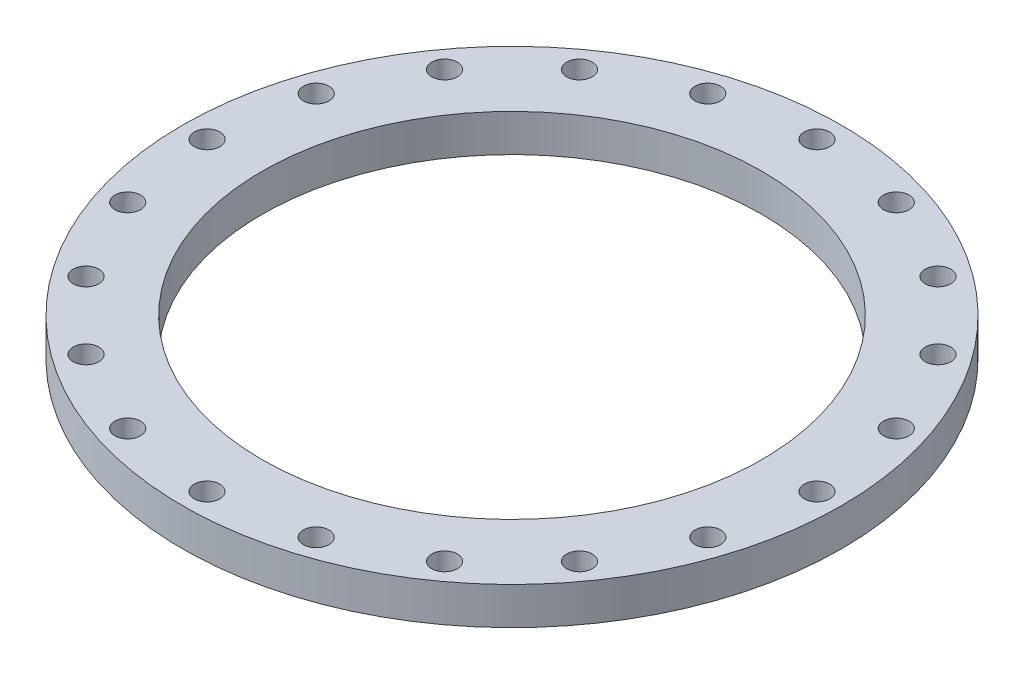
ISO-10303-21;
HEADER;
FILE_DESCRIPTION(('STEP AP214'),'2;1');
FILE_NAME('part.step','',(''),(''),'','','');
FILE_SCHEMA(('AUTOMOTIVE_DESIGN { 1 0 10303 214 1 1 1 1 }'));
ENDSEC;
DATA;
#1=APPLICATION_CONTEXT('core data for automotive mechanical design processes');
#2=APPLICATION_PROTOCOL_DEFINITION('international standard','automotive_design',2000,#1);
#3=PRODUCT_CONTEXT('',#1,'mechanical');
#4=PRODUCT('Part','Part','',(#3));
#5=PRODUCT_RELATED_PRODUCT_CATEGORY('part','',(#4));
#6=PRODUCT_DEFINITION_FORMATION('','',#4);
#7=PRODUCT_DEFINITION_CONTEXT('part definition',#1,'design');
#8=PRODUCT_DEFINITION('design','',#6,#7);
#9=PRODUCT_DEFINITION_SHAPE('','',#8);
#10=(LENGTH_UNIT() NAMED_UNIT(*) SI_UNIT(.MILLI.,.METRE.));
#11=(NAMED_UNIT(*) PLANE_ANGLE_UNIT() SI_UNIT($,.RADIAN.));
#12=(NAMED_UNIT(*) SI_UNIT($,.STERADIAN.) SOLID_ANGLE_UNIT());
#13=UNCERTAINTY_MEASURE_WITH_UNIT(LENGTH_MEASURE(1.E-05),#10,'distance_accuracy_value','');
#14=(GEOMETRIC_REPRESENTATION_CONTEXT(3) GLOBAL_UNCERTAINTY_ASSIGNED_CONTEXT((#13)) GLOBAL_UNIT_ASSIGNED_CONTEXT((#10,
#11,#12)) REPRESENTATION_CONTEXT('',''));
#15=CARTESIAN_POINT('',(0.,0.,0.));
#16=DIRECTION('',(0.,0.,1.));
#17=DIRECTION('',(1.,0.,0.));
#18=AXIS2_PLACEMENT_3D('',#15,#16,#17);
#19=CARTESIAN_POINT('',(0.,38.,0.));
#20=DIRECTION('',(0.,1.,0.));
#21=DIRECTION('',(0.,0.,1.));
#22=AXIS2_PLACEMENT_3D('',#19,#20,#21);
#23=PLANE('',#22);
#24=CARTESIAN_POINT('',(294.827520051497,38.,95.7952682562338));
#25=DIRECTION('',(0.,1.,0.));
#26=DIRECTION('',(0.,0.,1.));
#27=AXIS2_PLACEMENT_3D('',#24,#25,#26);
#28=CIRCLE('',#27,13.);
#29=CARTESIAN_POINT('',(294.827520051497,38.,108.795268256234));
#30=VERTEX_POINT('',#29);
#31=EDGE_CURVE('E133',#30,#30,#28,.T.);
#32=ORIENTED_EDGE('',*,*,#31,.F.);
#33=EDGE_LOOP('',(#32));
#34=FACE_BOUND('',#33,.T.);
#35=CARTESIAN_POINT('',(250.795268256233,38.,182.213428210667));
#36=DIRECTION('',(0.,1.,0.));
#37=DIRECTION('',(0.,0.,1.));
#38=AXIS2_PLACEMENT_3D('',#35,#36,#37);
#39=CIRCLE('',#38,13.);
#40=CARTESIAN_POINT('',(250.795268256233,38.,195.213428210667));
#41=VERTEX_POINT('',#40);
#42=EDGE_CURVE('E129',#41,#41,#39,.T.);
#43=ORIENTED_EDGE('',*,*,#42,.F.);
#44=EDGE_LOOP('',(#43));
#45=FACE_BOUND('',#44,.T.);
#46=CARTESIAN_POINT('',(182.213428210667,38.,250.795268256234));
#47=DIRECTION('',(0.,1.,0.));
#48=DIRECTION('',(0.,0.,1.));
#49=AXIS2_PLACEMENT_3D('',#46,#47,#48);
#50=CIRCLE('',#49,13.);
#51=CARTESIAN_POINT('',(182.213428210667,38.,263.795268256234));
#52=VERTEX_POINT('',#51);
#53=EDGE_CURVE('E125',#52,#52,#50,.T.);
#54=ORIENTED_EDGE('',*,*,#53,.F.);
#55=EDGE_LOOP('',(#54));
#56=FACE_BOUND('',#55,.T.);
#57=CARTESIAN_POINT('',(95.7952682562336,38.,294.827520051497));
#58=DIRECTION('',(0.,1.,0.));
#59=DIRECTION('',(0.,0.,1.));
#60=AXIS2_PLACEMENT_3D('',#57,#58,#59);
#61=CIRCLE('',#60,13.);
#62=CARTESIAN_POINT('',(95.7952682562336,38.,307.827520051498));
#63=VERTEX_POINT('',#62);
#64=EDGE_CURVE('E120',#63,#63,#61,.T.);
#65=ORIENTED_EDGE('',*,*,#64,.F.);
#66=EDGE_LOOP('',(#65));
#67=FACE_BOUND('',#66,.T.);
#68=CARTESIAN_POINT('',(0.,38.,310.));
#69=DIRECTION('',(0.,1.,0.));
#70=DIRECTION('',(0.,0.,1.));
#71=AXIS2_PLACEMENT_3D('',#68,#69,#70);
#72=CIRCLE('',#71,13.);
#73=CARTESIAN_POINT('',(0.,38.,323.));
#74=VERTEX_POINT('',#73);
#75=EDGE_CURVE('E115',#74,#74,#72,.T.);
#76=ORIENTED_EDGE('',*,*,#75,.F.);
#77=EDGE_LOOP('',(#76));
#78=FACE_BOUND('',#77,.T.);
#79=CARTESIAN_POINT('',(-95.7952682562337,38.,294.827520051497));
#80=DIRECTION('',(0.,1.,0.));
#81=DIRECTION('',(0.,0.,1.));
#82=AXIS2_PLACEMENT_3D('',#79,#80,#81);
#83=CIRCLE('',#82,13.);
#84=CARTESIAN_POINT('',(-95.7952682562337,38.,307.827520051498));
#85=VERTEX_POINT('',#84);
#86=EDGE_CURVE('E110',#85,#85,#83,.T.);
#87=ORIENTED_EDGE('',*,*,#86,.F.);
#88=EDGE_LOOP('',(#87));
#89=FACE_BOUND('',#88,.T.);
#90=CARTESIAN_POINT('',(-182.213428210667,38.,250.795268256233));
#91=DIRECTION('',(0.,1.,0.));
#92=DIRECTION('',(0.,0.,1.));
#93=AXIS2_PLACEMENT_3D('',#90,#91,#92);
#94=CIRCLE('',#93,13.);
#95=CARTESIAN_POINT('',(-182.213428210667,38.,263.795268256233));
#96=VERTEX_POINT('',#95);
#97=EDGE_CURVE('E105',#96,#96,#94,.T.);
#98=ORIENTED_EDGE('',*,*,#97,.F.);
#99=EDGE_LOOP('',(#98));
#100=FACE_BOUND('',#99,.T.);
#101=CARTESIAN_POINT('',(-250.795268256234,38.,182.213428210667));
#102=DIRECTION('',(0.,1.,0.));
#103=DIRECTION('',(0.,0.,1.));
#104=AXIS2_PLACEMENT_3D('',#101,#102,#103);
#105=CIRCLE('',#104,13.);
#106=CARTESIAN_POINT('',(-250.795268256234,38.,195.213428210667));
#107=VERTEX_POINT('',#106);
#108=EDGE_CURVE('E100',#107,#107,#105,.T.);
#109=ORIENTED_EDGE('',*,*,#108,.F.);
#110=EDGE_LOOP('',(#109));
#111=FACE_BOUND('',#110,.T.);
#112=CARTESIAN_POINT('',(-294.827520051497,38.,95.7952682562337));
#113=DIRECTION('',(0.,1.,0.));
#114=DIRECTION('',(0.,0.,1.));
#115=AXIS2_PLACEMENT_3D('',#112,#113,#114);
#116=CIRCLE('',#115,13.);
#117=CARTESIAN_POINT('',(-294.827520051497,38.,108.795268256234));
#118=VERTEX_POINT('',#117);
#119=EDGE_CURVE('E95',#118,#118,#116,.T.);
#120=ORIENTED_EDGE('',*,*,#119,.F.);
#121=EDGE_LOOP('',(#120));
#122=FACE_BOUND('',#121,.T.);
#123=CARTESIAN_POINT('',(-310.,38.,0.));
#124=DIRECTION('',(0.,1.,0.));
#125=DIRECTION('',(0.,0.,1.));
#126=AXIS2_PLACEMENT_3D('',#123,#124,#125);
#127=CIRCLE('',#126,13.);
#128=CARTESIAN_POINT('',(-310.,38.,13.));
#129=VERTEX_POINT('',#128);
#130=EDGE_CURVE('E90',#129,#129,#127,.T.);
#131=ORIENTED_EDGE('',*,*,#130,.F.);
#132=EDGE_LOOP('',(#131));
#133=FACE_BOUND('',#132,.T.);
#134=CARTESIAN_POINT('',(-294.827520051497,38.,-95.7952682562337));
#135=DIRECTION('',(0.,1.,0.));
#136=DIRECTION('',(0.,0.,1.));
#137=AXIS2_PLACEMENT_3D('',#134,#135,#136);
#138=CIRCLE('',#137,13.);
#139=CARTESIAN_POINT('',(-294.827520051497,38.,-82.7952682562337));
#140=VERTEX_POINT('',#139);
#141=EDGE_CURVE('E85',#140,#140,#138,.T.);
#142=ORIENTED_EDGE('',*,*,#141,.F.);
#143=EDGE_LOOP('',(#142));
#144=FACE_BOUND('',#143,.T.);
#145=CARTESIAN_POINT('',(-250.795268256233,38.,-182.213428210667));
#146=DIRECTION('',(0.,1.,0.));
#147=DIRECTION('',(0.,0.,1.));
#148=AXIS2_PLACEMENT_3D('',#145,#146,#147);
#149=CIRCLE('',#148,13.);
#150=CARTESIAN_POINT('',(-250.795268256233,38.,-169.213428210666));
#151=VERTEX_POINT('',#150);
#152=EDGE_CURVE('E80',#151,#151,#149,.T.);
#153=ORIENTED_EDGE('',*,*,#152,.F.);
#154=EDGE_LOOP('',(#153));
#155=FACE_BOUND('',#154,.T.);
#156=CARTESIAN_POINT('',(-182.213428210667,38.,-250.795268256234));
#157=DIRECTION('',(0.,1.,0.));
#158=DIRECTION('',(0.,0.,1.));
#159=AXIS2_PLACEMENT_3D('',#156,#157,#158);
#160=CIRCLE('',#159,13.);
#161=CARTESIAN_POINT('',(-182.213428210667,38.,-237.795268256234));
#162=VERTEX_POINT('',#161);
#163=EDGE_CURVE('E75',#162,#162,#160,.T.);
#164=ORIENTED_EDGE('',*,*,#163,.F.);
#165=EDGE_LOOP('',(#164));
#166=FACE_BOUND('',#165,.T.);
#167=CARTESIAN_POINT('',(-95.7952682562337,38.,-294.827520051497));
#168=DIRECTION('',(0.,1.,0.));
#169=DIRECTION('',(0.,0.,1.));
#170=AXIS2_PLACEMENT_3D('',#167,#168,#169);
#171=CIRCLE('',#170,13.);
#172=CARTESIAN_POINT('',(-95.7952682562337,38.,-281.827520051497));
#173=VERTEX_POINT('',#172);
#174=EDGE_CURVE('E70',#173,#173,#171,.T.);
#175=ORIENTED_EDGE('',*,*,#174,.F.);
#176=EDGE_LOOP('',(#175));
#177=FACE_BOUND('',#176,.T.);
#178=CARTESIAN_POINT('',(0.,38.,-310.));
#179=DIRECTION('',(0.,1.,0.));
#180=DIRECTION('',(0.,0.,1.));
#181=AXIS2_PLACEMENT_3D('',#178,#179,#180);
#182=CIRCLE('',#181,13.);
#183=CARTESIAN_POINT('',(0.,38.,-297.));
#184=VERTEX_POINT('',#183);
#185=EDGE_CURVE('E65',#184,#184,#182,.T.);
#186=ORIENTED_EDGE('',*,*,#185,.F.);
#187=EDGE_LOOP('',(#186));
#188=FACE_BOUND('',#187,.T.);
#189=CARTESIAN_POINT('',(95.7952682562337,38.,-294.827520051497));
#190=DIRECTION('',(0.,1.,0.));
#191=DIRECTION('',(0.,0.,1.));
#192=AXIS2_PLACEMENT_3D('',#189,#190,#191);
#193=CIRCLE('',#192,13.);
#194=CARTESIAN_POINT('',(95.7952682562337,38.,-281.827520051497));
#195=VERTEX_POINT('',#194);
#196=EDGE_CURVE('E60',#195,#195,#193,.T.);
#197=ORIENTED_EDGE('',*,*,#196,.F.);
#198=EDGE_LOOP('',(#197));
#199=FACE_BOUND('',#198,.T.);
#200=CARTESIAN_POINT('',(182.213428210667,38.,-250.795268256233));
#201=DIRECTION('',(0.,1.,0.));
#202=DIRECTION('',(0.,0.,1.));
#203=AXIS2_PLACEMENT_3D('',#200,#201,#202);
#204=CIRCLE('',#203,13.);
#205=CARTESIAN_POINT('',(182.213428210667,38.,-237.795268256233));
#206=VERTEX_POINT('',#205);
#207=EDGE_CURVE('E55',#206,#206,#204,.T.);
#208=ORIENTED_EDGE('',*,*,#207,.F.);
#209=EDGE_LOOP('',(#208));
#210=FACE_BOUND('',#209,.T.);
#211=CARTESIAN_POINT('',(250.795268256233,38.,-182.213428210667));
#212=DIRECTION('',(0.,1.,0.));
#213=DIRECTION('',(0.,0.,1.));
#214=AXIS2_PLACEMENT_3D('',#211,#212,#213);
#215=CIRCLE('',#214,13.);
#216=CARTESIAN_POINT('',(250.795268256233,38.,-169.213428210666));
#217=VERTEX_POINT('',#216);
#218=EDGE_CURVE('E50',#217,#217,#215,.T.);
#219=ORIENTED_EDGE('',*,*,#218,.F.);
#220=EDGE_LOOP('',(#219));
#221=FACE_BOUND('',#220,.T.);
#222=CARTESIAN_POINT('',(294.827520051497,38.,-95.7952682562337));
#223=DIRECTION('',(0.,1.,0.));
#224=DIRECTION('',(0.,0.,1.));
#225=AXIS2_PLACEMENT_3D('',#222,#223,#224);
#226=CIRCLE('',#225,13.);
#227=CARTESIAN_POINT('',(294.827520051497,38.,-82.7952682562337));
#228=VERTEX_POINT('',#227);
#229=EDGE_CURVE('E45',#228,#228,#226,.T.);
#230=ORIENTED_EDGE('',*,*,#229,.F.);
#231=EDGE_LOOP('',(#230));
#232=FACE_BOUND('',#231,.T.);
#233=CARTESIAN_POINT('',(310.,38.,0.));
#234=DIRECTION('',(0.,1.,0.));
#235=DIRECTION('',(0.,0.,1.));
#236=AXIS2_PLACEMENT_3D('',#233,#234,#235);
#237=CIRCLE('',#236,13.);
#238=CARTESIAN_POINT('',(310.,38.,13.));
#239=VERTEX_POINT('',#238);
#240=EDGE_CURVE('E40',#239,#239,#237,.T.);
#241=ORIENTED_EDGE('',*,*,#240,.F.);
#242=EDGE_LOOP('',(#241));
#243=FACE_BOUND('',#242,.T.);
#244=CARTESIAN_POINT('',(0.,38.,0.));
#245=DIRECTION('',(0.,1.,0.));
#246=DIRECTION('',(0.,0.,1.));
#247=AXIS2_PLACEMENT_3D('',#244,#245,#246);
#248=CIRCLE('',#247,254.);
#249=CARTESIAN_POINT('',(0.,38.,254.));
#250=VERTEX_POINT('',#249);
#251=EDGE_CURVE('E32',#250,#250,#248,.T.);
#252=ORIENTED_EDGE('',*,*,#251,.F.);
#253=EDGE_LOOP('',(#252));
#254=FACE_BOUND('',#253,.T.);
#255=CARTESIAN_POINT('',(0.,38.,0.));
#256=DIRECTION('',(0.,-1.,0.));
#257=DIRECTION('',(1.,0.,0.));
#258=AXIS2_PLACEMENT_3D('',#255,#256,#257);
#259=CIRCLE('',#258,335.);
#260=CARTESIAN_POINT('',(335.,38.,0.));
#261=VERTEX_POINT('',#260);
#262=EDGE_CURVE('E8',#261,#261,#259,.T.);
#263=ORIENTED_EDGE('',*,*,#262,.F.);
#264=EDGE_LOOP('',(#263));
#265=FACE_BOUND('',#264,.T.);
#266=ADVANCED_FACE('F13',(#34,#45,#56,#67,#78,#89,#100,#111,#122,#133,#144,#155,#166,#177,#188,
#199,#210,#221,#232,#243,#254,#265),#23,.T.);
#267=CARTESIAN_POINT('',(0.,0.,0.));
#268=DIRECTION('',(0.,-1.,0.));
#269=DIRECTION('',(0.,0.,-1.));
#270=AXIS2_PLACEMENT_3D('',#267,#268,#269);
#271=PLANE('',#270);
#272=CARTESIAN_POINT('',(294.827520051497,0.,95.7952682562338));
#273=DIRECTION('',(0.,-1.,0.));
#274=DIRECTION('',(0.,0.,-1.));
#275=AXIS2_PLACEMENT_3D('',#272,#273,#274);
#276=CIRCLE('',#275,13.);
#277=CARTESIAN_POINT('',(294.827520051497,0.,82.7952682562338));
#278=VERTEX_POINT('',#277);
#279=EDGE_CURVE('E17',#278,#278,#276,.T.);
#280=ORIENTED_EDGE('',*,*,#279,.F.);
#281=EDGE_LOOP('',(#280));
#282=FACE_BOUND('',#281,.T.);
#283=CARTESIAN_POINT('',(250.795268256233,0.,182.213428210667));
#284=DIRECTION('',(0.,-1.,0.));
#285=DIRECTION('',(0.,0.,-1.));
#286=AXIS2_PLACEMENT_3D('',#283,#284,#285);
#287=CIRCLE('',#286,13.);
#288=CARTESIAN_POINT('',(250.795268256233,0.,169.213428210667));
#289=VERTEX_POINT('',#288);
#290=EDGE_CURVE('E130',#289,#289,#287,.T.);
#291=ORIENTED_EDGE('',*,*,#290,.F.);
#292=EDGE_LOOP('',(#291));
#293=FACE_BOUND('',#292,.T.);
#294=CARTESIAN_POINT('',(182.213428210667,0.,250.795268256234));
#295=DIRECTION('',(0.,-1.,0.));
#296=DIRECTION('',(0.,0.,-1.));
#297=AXIS2_PLACEMENT_3D('',#294,#295,#296);
#298=CIRCLE('',#297,13.);
#299=CARTESIAN_POINT('',(182.213428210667,0.,237.795268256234));
#300=VERTEX_POINT('',#299);
#301=EDGE_CURVE('E126',#300,#300,#298,.T.);
#302=ORIENTED_EDGE('',*,*,#301,.F.);
#303=EDGE_LOOP('',(#302));
#304=FACE_BOUND('',#303,.T.);
#305=CARTESIAN_POINT('',(95.7952682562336,0.,294.827520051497));
#306=DIRECTION('',(0.,-1.,0.));
#307=DIRECTION('',(0.,0.,-1.));
#308=AXIS2_PLACEMENT_3D('',#305,#306,#307);
#309=CIRCLE('',#308,13.);
#310=CARTESIAN_POINT('',(95.7952682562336,0.,281.827520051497));
#311=VERTEX_POINT('',#310);
#312=EDGE_CURVE('E121',#311,#311,#309,.T.);
#313=ORIENTED_EDGE('',*,*,#312,.F.);
#314=EDGE_LOOP('',(#313));
#315=FACE_BOUND('',#314,.T.);
#316=CARTESIAN_POINT('',(0.,0.,310.));
#317=DIRECTION('',(0.,-1.,0.));
#318=DIRECTION('',(0.,0.,-1.));
#319=AXIS2_PLACEMENT_3D('',#316,#317,#318);
#320=CIRCLE('',#319,13.);
#321=CARTESIAN_POINT('',(0.,0.,297.));
#322=VERTEX_POINT('',#321);
#323=EDGE_CURVE('E116',#322,#322,#320,.T.);
#324=ORIENTED_EDGE('',*,*,#323,.F.);
#325=EDGE_LOOP('',(#324));
#326=FACE_BOUND('',#325,.T.);
#327=CARTESIAN_POINT('',(-95.7952682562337,0.,294.827520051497));
#328=DIRECTION('',(0.,-1.,0.));
#329=DIRECTION('',(0.,0.,-1.));
#330=AXIS2_PLACEMENT_3D('',#327,#328,#329);
#331=CIRCLE('',#330,13.);
#332=CARTESIAN_POINT('',(-95.7952682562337,0.,281.827520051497));
#333=VERTEX_POINT('',#332);
#334=EDGE_CURVE('E111',#333,#333,#331,.T.);
#335=ORIENTED_EDGE('',*,*,#334,.F.);
#336=EDGE_LOOP('',(#335));
#337=FACE_BOUND('',#336,.T.);
#338=CARTESIAN_POINT('',(-182.213428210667,0.,250.795268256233));
#339=DIRECTION('',(0.,-1.,0.));
#340=DIRECTION('',(0.,0.,-1.));
#341=AXIS2_PLACEMENT_3D('',#338,#339,#340);
#342=CIRCLE('',#341,13.);
#343=CARTESIAN_POINT('',(-182.213428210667,0.,237.795268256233));
#344=VERTEX_POINT('',#343);
#345=EDGE_CURVE('E106',#344,#344,#342,.T.);
#346=ORIENTED_EDGE('',*,*,#345,.F.);
#347=EDGE_LOOP('',(#346));
#348=FACE_BOUND('',#347,.T.);
#349=CARTESIAN_POINT('',(-250.795268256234,0.,182.213428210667));
#350=DIRECTION('',(0.,-1.,0.));
#351=DIRECTION('',(0.,0.,-1.));
#352=AXIS2_PLACEMENT_3D('',#349,#350,#351);
#353=CIRCLE('',#352,13.);
#354=CARTESIAN_POINT('',(-250.795268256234,0.,169.213428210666));
#355=VERTEX_POINT('',#354);
#356=EDGE_CURVE('E101',#355,#355,#353,.T.);
#357=ORIENTED_EDGE('',*,*,#356,.F.);
#358=EDGE_LOOP('',(#357));
#359=FACE_BOUND('',#358,.T.);
#360=CARTESIAN_POINT('',(-294.827520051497,0.,95.7952682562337));
#361=DIRECTION('',(0.,-1.,0.));
#362=DIRECTION('',(0.,0.,-1.));
#363=AXIS2_PLACEMENT_3D('',#360,#361,#362);
#364=CIRCLE('',#363,13.);
#365=CARTESIAN_POINT('',(-294.827520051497,0.,82.7952682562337));
#366=VERTEX_POINT('',#365);
#367=EDGE_CURVE('E96',#366,#366,#364,.T.);
#368=ORIENTED_EDGE('',*,*,#367,.F.);
#369=EDGE_LOOP('',(#368));
#370=FACE_BOUND('',#369,.T.);
#371=CARTESIAN_POINT('',(-310.,0.,0.));
#372=DIRECTION('',(0.,-1.,0.));
#373=DIRECTION('',(0.,0.,-1.));
#374=AXIS2_PLACEMENT_3D('',#371,#372,#373);
#375=CIRCLE('',#374,13.);
#376=CARTESIAN_POINT('',(-310.,0.,-13.));
#377=VERTEX_POINT('',#376);
#378=EDGE_CURVE('E91',#377,#377,#375,.T.);
#379=ORIENTED_EDGE('',*,*,#378,.F.);
#380=EDGE_LOOP('',(#379));
#381=FACE_BOUND('',#380,.T.);
#382=CARTESIAN_POINT('',(-294.827520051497,0.,-95.7952682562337));
#383=DIRECTION('',(0.,-1.,0.));
#384=DIRECTION('',(0.,0.,-1.));
#385=AXIS2_PLACEMENT_3D('',#382,#383,#384);
#386=CIRCLE('',#385,13.);
#387=CARTESIAN_POINT('',(-294.827520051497,0.,-108.795268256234));
#388=VERTEX_POINT('',#387);
#389=EDGE_CURVE('E86',#388,#388,#386,.T.);
#390=ORIENTED_EDGE('',*,*,#389,.F.);
#391=EDGE_LOOP('',(#390));
#392=FACE_BOUND('',#391,.T.);
#393=CARTESIAN_POINT('',(-250.795268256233,0.,-182.213428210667));
#394=DIRECTION('',(0.,-1.,0.));
#395=DIRECTION('',(0.,0.,-1.));
#396=AXIS2_PLACEMENT_3D('',#393,#394,#395);
#397=CIRCLE('',#396,13.);
#398=CARTESIAN_POINT('',(-250.795268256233,0.,-195.213428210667));
#399=VERTEX_POINT('',#398);
#400=EDGE_CURVE('E81',#399,#399,#397,.T.);
#401=ORIENTED_EDGE('',*,*,#400,.F.);
#402=EDGE_LOOP('',(#401));
#403=FACE_BOUND('',#402,.T.);
#404=CARTESIAN_POINT('',(-182.213428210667,0.,-250.795268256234));
#405=DIRECTION('',(0.,-1.,0.));
#406=DIRECTION('',(0.,0.,-1.));
#407=AXIS2_PLACEMENT_3D('',#404,#405,#406);
#408=CIRCLE('',#407,13.);
#409=CARTESIAN_POINT('',(-182.213428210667,0.,-263.795268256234));
#410=VERTEX_POINT('',#409);
#411=EDGE_CURVE('E76',#410,#410,#408,.T.);
#412=ORIENTED_EDGE('',*,*,#411,.F.);
#413=EDGE_LOOP('',(#412));
#414=FACE_BOUND('',#413,.T.);
#415=CARTESIAN_POINT('',(-95.7952682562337,0.,-294.827520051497));
#416=DIRECTION('',(0.,-1.,0.));
#417=DIRECTION('',(0.,0.,-1.));
#418=AXIS2_PLACEMENT_3D('',#415,#416,#417);
#419=CIRCLE('',#418,13.);
#420=CARTESIAN_POINT('',(-95.7952682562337,0.,-307.827520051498));
#421=VERTEX_POINT('',#420);
#422=EDGE_CURVE('E71',#421,#421,#419,.T.);
#423=ORIENTED_EDGE('',*,*,#422,.F.);
#424=EDGE_LOOP('',(#423));
#425=FACE_BOUND('',#424,.T.);
#426=CARTESIAN_POINT('',(0.,0.,-310.));
#427=DIRECTION('',(0.,-1.,0.));
#428=DIRECTION('',(0.,0.,-1.));
#429=AXIS2_PLACEMENT_3D('',#426,#427,#428);
#430=CIRCLE('',#429,13.);
#431=CARTESIAN_POINT('',(0.,0.,-323.));
#432=VERTEX_POINT('',#431);
#433=EDGE_CURVE('E66',#432,#432,#430,.T.);
#434=ORIENTED_EDGE('',*,*,#433,.F.);
#435=EDGE_LOOP('',(#434));
#436=FACE_BOUND('',#435,.T.);
#437=CARTESIAN_POINT('',(95.7952682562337,0.,-294.827520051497));
#438=DIRECTION('',(0.,-1.,0.));
#439=DIRECTION('',(0.,0.,-1.));
#440=AXIS2_PLACEMENT_3D('',#437,#438,#439);
#441=CIRCLE('',#440,13.);
#442=CARTESIAN_POINT('',(95.7952682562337,0.,-307.827520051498));
#443=VERTEX_POINT('',#442);
#444=EDGE_CURVE('E61',#443,#443,#441,.T.);
#445=ORIENTED_EDGE('',*,*,#444,.F.);
#446=EDGE_LOOP('',(#445));
#447=FACE_BOUND('',#446,.T.);
#448=CARTESIAN_POINT('',(182.213428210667,0.,-250.795268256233));
#449=DIRECTION('',(0.,-1.,0.));
#450=DIRECTION('',(0.,0.,-1.));
#451=AXIS2_PLACEMENT_3D('',#448,#449,#450);
#452=CIRCLE('',#451,13.);
#453=CARTESIAN_POINT('',(182.213428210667,0.,-263.795268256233));
#454=VERTEX_POINT('',#453);
#455=EDGE_CURVE('E56',#454,#454,#452,.T.);
#456=ORIENTED_EDGE('',*,*,#455,.F.);
#457=EDGE_LOOP('',(#456));
#458=FACE_BOUND('',#457,.T.);
#459=CARTESIAN_POINT('',(250.795268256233,0.,-182.213428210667));
#460=DIRECTION('',(0.,-1.,0.));
#461=DIRECTION('',(0.,0.,-1.));
#462=AXIS2_PLACEMENT_3D('',#459,#460,#461);
#463=CIRCLE('',#462,13.);
#464=CARTESIAN_POINT('',(250.795268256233,0.,-195.213428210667));
#465=VERTEX_POINT('',#464);
#466=EDGE_CURVE('E51',#465,#465,#463,.T.);
#467=ORIENTED_EDGE('',*,*,#466,.F.);
#468=EDGE_LOOP('',(#467));
#469=FACE_BOUND('',#468,.T.);
#470=CARTESIAN_POINT('',(294.827520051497,0.,-95.7952682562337));
#471=DIRECTION('',(0.,-1.,0.));
#472=DIRECTION('',(0.,0.,-1.));
#473=AXIS2_PLACEMENT_3D('',#470,#471,#472);
#474=CIRCLE('',#473,13.);
#475=CARTESIAN_POINT('',(294.827520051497,0.,-108.795268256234));
#476=VERTEX_POINT('',#475);
#477=EDGE_CURVE('E46',#476,#476,#474,.T.);
#478=ORIENTED_EDGE('',*,*,#477,.F.);
#479=EDGE_LOOP('',(#478));
#480=FACE_BOUND('',#479,.T.);
#481=CARTESIAN_POINT('',(310.,0.,0.));
#482=DIRECTION('',(0.,-1.,0.));
#483=DIRECTION('',(0.,0.,-1.));
#484=AXIS2_PLACEMENT_3D('',#481,#482,#483);
#485=CIRCLE('',#484,13.);
#486=CARTESIAN_POINT('',(310.,0.,-13.));
#487=VERTEX_POINT('',#486);
#488=EDGE_CURVE('E41',#487,#487,#485,.T.);
#489=ORIENTED_EDGE('',*,*,#488,.F.);
#490=EDGE_LOOP('',(#489));
#491=FACE_BOUND('',#490,.T.);
#492=CARTESIAN_POINT('',(0.,0.,0.));
#493=DIRECTION('',(0.,-1.,0.));
#494=DIRECTION('',(0.,0.,-1.));
#495=AXIS2_PLACEMENT_3D('',#492,#493,#494);
#496=CIRCLE('',#495,254.);
#497=CARTESIAN_POINT('',(0.,0.,-254.));
#498=VERTEX_POINT('',#497);
#499=EDGE_CURVE('E36',#498,#498,#496,.T.);
#500=ORIENTED_EDGE('',*,*,#499,.F.);
#501=EDGE_LOOP('',(#500));
#502=FACE_BOUND('',#501,.T.);
#503=CARTESIAN_POINT('',(0.,0.,0.));
#504=DIRECTION('',(0.,1.,0.));
#505=DIRECTION('',(1.,0.,0.));
#506=AXIS2_PLACEMENT_3D('',#503,#504,#505);
#507=CIRCLE('',#506,335.);
#508=CARTESIAN_POINT('',(335.,0.,0.));
#509=VERTEX_POINT('',#508);
#510=EDGE_CURVE('E22',#509,#509,#507,.T.);
#511=ORIENTED_EDGE('',*,*,#510,.F.);
#512=EDGE_LOOP('',(#511));
#513=FACE_BOUND('',#512,.T.);
#514=ADVANCED_FACE('F212',(#282,#293,#304,#315,#326,#337,#348,#359,#370,#381,#392,#403,#414,
#425,#436,#447,#458,#469,#480,#491,#502,#513),#271,.T.);
#515=CARTESIAN_POINT('',(0.,0.,0.));
#516=DIRECTION('',(0.,1.,0.));
#517=DIRECTION('',(1.,0.,0.));
#518=AXIS2_PLACEMENT_3D('',#515,#516,#517);
#519=CYLINDRICAL_SURFACE('',#518,335.);
#520=ORIENTED_EDGE('',*,*,#262,.T.);
#521=EDGE_LOOP('',(#520));
#522=FACE_BOUND('',#521,.T.);
#523=ORIENTED_EDGE('',*,*,#510,.T.);
#524=EDGE_LOOP('',(#523));
#525=FACE_BOUND('',#524,.T.);
#526=ADVANCED_FACE('F15',(#522,#525),#519,.T.);
#527=CARTESIAN_POINT('',(0.,-3.8,0.));
#528=DIRECTION('',(0.,1.,0.));
#529=DIRECTION('',(1.,0.,0.));
#530=AXIS2_PLACEMENT_3D('',#527,#528,#529);
#531=CYLINDRICAL_SURFACE('',#530,254.);
#532=ORIENTED_EDGE('',*,*,#251,.T.);
#533=EDGE_LOOP('',(#532));
#534=FACE_BOUND('',#533,.T.);
#535=ORIENTED_EDGE('',*,*,#499,.T.);
#536=EDGE_LOOP('',(#535));
#537=FACE_BOUND('',#536,.T.);
#538=ADVANCED_FACE('F207',(#534,#537),#531,.F.);
#539=CARTESIAN_POINT('',(310.,-19.,0.));
#540=DIRECTION('',(0.,1.,0.));
#541=DIRECTION('',(1.,0.,0.));
#542=AXIS2_PLACEMENT_3D('',#539,#540,#541);
#543=CYLINDRICAL_SURFACE('',#542,13.);
#544=ORIENTED_EDGE('',*,*,#240,.T.);
#545=EDGE_LOOP('',(#544));
#546=FACE_BOUND('',#545,.T.);
#547=ORIENTED_EDGE('',*,*,#488,.T.);
#548=EDGE_LOOP('',(#547));
#549=FACE_BOUND('',#548,.T.);
#550=ADVANCED_FACE('F224',(#546,#549),#543,.F.);
#551=CARTESIAN_POINT('',(294.827520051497,-19.,-95.7952682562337));
#552=DIRECTION('',(0.,1.,0.));
#553=DIRECTION('',(0.951056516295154,0.,-0.309016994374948));
#554=AXIS2_PLACEMENT_3D('',#551,#552,#553);
#555=CYLINDRICAL_SURFACE('',#554,13.);
#556=ORIENTED_EDGE('',*,*,#229,.T.);
#557=EDGE_LOOP('',(#556));
#558=FACE_BOUND('',#557,.T.);
#559=ORIENTED_EDGE('',*,*,#477,.T.);
#560=EDGE_LOOP('',(#559));
#561=FACE_BOUND('',#560,.T.);
#562=ADVANCED_FACE('F227',(#558,#561),#555,.F.);
#563=CARTESIAN_POINT('',(250.795268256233,-19.,-182.213428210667));
#564=DIRECTION('',(0.,1.,0.));
#565=DIRECTION('',(0.809016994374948,0.,-0.587785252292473));
#566=AXIS2_PLACEMENT_3D('',#563,#564,#565);
#567=CYLINDRICAL_SURFACE('',#566,13.);
#568=ORIENTED_EDGE('',*,*,#218,.T.);
#569=EDGE_LOOP('',(#568));
#570=FACE_BOUND('',#569,.T.);
#571=ORIENTED_EDGE('',*,*,#466,.T.);
#572=EDGE_LOOP('',(#571));
#573=FACE_BOUND('',#572,.T.);
#574=ADVANCED_FACE('F231',(#570,#573),#567,.F.);
#575=CARTESIAN_POINT('',(182.213428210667,-19.,-250.795268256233));
#576=DIRECTION('',(0.,1.,0.));
#577=DIRECTION('',(0.587785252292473,0.,-0.809016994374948));
#578=AXIS2_PLACEMENT_3D('',#575,#576,#577);
#579=CYLINDRICAL_SURFACE('',#578,13.);
#580=ORIENTED_EDGE('',*,*,#207,.T.);
#581=EDGE_LOOP('',(#580));
#582=FACE_BOUND('',#581,.T.);
#583=ORIENTED_EDGE('',*,*,#455,.T.);
#584=EDGE_LOOP('',(#583));
#585=FACE_BOUND('',#584,.T.);
#586=ADVANCED_FACE('F235',(#582,#585),#579,.F.);
#587=CARTESIAN_POINT('',(95.7952682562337,-19.,-294.827520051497));
#588=DIRECTION('',(0.,1.,0.));
#589=DIRECTION('',(0.309016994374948,0.,-0.951056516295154));
#590=AXIS2_PLACEMENT_3D('',#587,#588,#589);
#591=CYLINDRICAL_SURFACE('',#590,13.);
#592=ORIENTED_EDGE('',*,*,#196,.T.);
#593=EDGE_LOOP('',(#592));
#594=FACE_BOUND('',#593,.T.);
#595=ORIENTED_EDGE('',*,*,#444,.T.);
#596=EDGE_LOOP('',(#595));
#597=FACE_BOUND('',#596,.T.);
#598=ADVANCED_FACE('F239',(#594,#597),#591,.F.);
#599=CARTESIAN_POINT('',(0.,-19.,-310.));
#600=DIRECTION('',(0.,1.,0.));
#601=DIRECTION('',(0.,0.,-1.));
#602=AXIS2_PLACEMENT_3D('',#599,#600,#601);
#603=CYLINDRICAL_SURFACE('',#602,13.);
#604=ORIENTED_EDGE('',*,*,#185,.T.);
#605=EDGE_LOOP('',(#604));
#606=FACE_BOUND('',#605,.T.);
#607=ORIENTED_EDGE('',*,*,#433,.T.);
#608=EDGE_LOOP('',(#607));
#609=FACE_BOUND('',#608,.T.);
#610=ADVANCED_FACE('F243',(#606,#609),#603,.F.);
#611=CARTESIAN_POINT('',(-95.7952682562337,-19.,-294.827520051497));
#612=DIRECTION('',(0.,1.,0.));
#613=DIRECTION('',(-0.309016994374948,0.,-0.951056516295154));
#614=AXIS2_PLACEMENT_3D('',#611,#612,#613);
#615=CYLINDRICAL_SURFACE('',#614,13.);
#616=ORIENTED_EDGE('',*,*,#174,.T.);
#617=EDGE_LOOP('',(#616));
#618=FACE_BOUND('',#617,.T.);
#619=ORIENTED_EDGE('',*,*,#422,.T.);
#620=EDGE_LOOP('',(#619));
#621=FACE_BOUND('',#620,.T.);
#622=ADVANCED_FACE('F247',(#618,#621),#615,.F.);
#623=CARTESIAN_POINT('',(-182.213428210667,-19.,-250.795268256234));
#624=DIRECTION('',(0.,1.,0.));
#625=DIRECTION('',(-0.587785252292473,0.,-0.809016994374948));
#626=AXIS2_PLACEMENT_3D('',#623,#624,#625);
#627=CYLINDRICAL_SURFACE('',#626,13.);
#628=ORIENTED_EDGE('',*,*,#163,.T.);
#629=EDGE_LOOP('',(#628));
#630=FACE_BOUND('',#629,.T.);
#631=ORIENTED_EDGE('',*,*,#411,.T.);
#632=EDGE_LOOP('',(#631));
#633=FACE_BOUND('',#632,.T.);
#634=ADVANCED_FACE('F251',(#630,#633),#627,.F.);
#635=CARTESIAN_POINT('',(-250.795268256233,-19.,-182.213428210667));
#636=DIRECTION('',(0.,1.,0.));
#637=DIRECTION('',(-0.809016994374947,0.,-0.587785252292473));
#638=AXIS2_PLACEMENT_3D('',#635,#636,#637);
#639=CYLINDRICAL_SURFACE('',#638,13.);
#640=ORIENTED_EDGE('',*,*,#152,.T.);
#641=EDGE_LOOP('',(#640));
#642=FACE_BOUND('',#641,.T.);
#643=ORIENTED_EDGE('',*,*,#400,.T.);
#644=EDGE_LOOP('',(#643));
#645=FACE_BOUND('',#644,.T.);
#646=ADVANCED_FACE('F255',(#642,#645),#639,.F.);
#647=CARTESIAN_POINT('',(-294.827520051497,-19.,-95.7952682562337));
#648=DIRECTION('',(0.,1.,0.));
#649=DIRECTION('',(-0.951056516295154,0.,-0.309016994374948));
#650=AXIS2_PLACEMENT_3D('',#647,#648,#649);
#651=CYLINDRICAL_SURFACE('',#650,13.);
#652=ORIENTED_EDGE('',*,*,#141,.T.);
#653=EDGE_LOOP('',(#652));
#654=FACE_BOUND('',#653,.T.);
#655=ORIENTED_EDGE('',*,*,#389,.T.);
#656=EDGE_LOOP('',(#655));
#657=FACE_BOUND('',#656,.T.);
#658=ADVANCED_FACE('F259',(#654,#657),#651,.F.);
#659=CARTESIAN_POINT('',(-310.,-19.,0.));
#660=DIRECTION('',(0.,1.,0.));
#661=DIRECTION('',(-1.,0.,0.));
#662=AXIS2_PLACEMENT_3D('',#659,#660,#661);
#663=CYLINDRICAL_SURFACE('',#662,13.);
#664=ORIENTED_EDGE('',*,*,#130,.T.);
#665=EDGE_LOOP('',(#664));
#666=FACE_BOUND('',#665,.T.);
#667=ORIENTED_EDGE('',*,*,#378,.T.);
#668=EDGE_LOOP('',(#667));
#669=FACE_BOUND('',#668,.T.);
#670=ADVANCED_FACE('F263',(#666,#669),#663,.F.);
#671=CARTESIAN_POINT('',(-294.827520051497,-19.,95.7952682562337));
#672=DIRECTION('',(0.,1.,0.));
#673=DIRECTION('',(-0.951056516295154,0.,0.309016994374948));
#674=AXIS2_PLACEMENT_3D('',#671,#672,#673);
#675=CYLINDRICAL_SURFACE('',#674,13.);
#676=ORIENTED_EDGE('',*,*,#119,.T.);
#677=EDGE_LOOP('',(#676));
#678=FACE_BOUND('',#677,.T.);
#679=ORIENTED_EDGE('',*,*,#367,.T.);
#680=EDGE_LOOP('',(#679));
#681=FACE_BOUND('',#680,.T.);
#682=ADVANCED_FACE('F267',(#678,#681),#675,.F.);
#683=CARTESIAN_POINT('',(-250.795268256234,-19.,182.213428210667));
#684=DIRECTION('',(0.,1.,0.));
#685=DIRECTION('',(-0.809016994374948,0.,0.587785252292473));
#686=AXIS2_PLACEMENT_3D('',#683,#684,#685);
#687=CYLINDRICAL_SURFACE('',#686,13.);
#688=ORIENTED_EDGE('',*,*,#108,.T.);
#689=EDGE_LOOP('',(#688));
#690=FACE_BOUND('',#689,.T.);
#691=ORIENTED_EDGE('',*,*,#356,.T.);
#692=EDGE_LOOP('',(#691));
#693=FACE_BOUND('',#692,.T.);
#694=ADVANCED_FACE('F271',(#690,#693),#687,.F.);
#695=CARTESIAN_POINT('',(-182.213428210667,-19.,250.795268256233));
#696=DIRECTION('',(0.,1.,0.));
#697=DIRECTION('',(-0.587785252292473,0.,0.809016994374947));
#698=AXIS2_PLACEMENT_3D('',#695,#696,#697);
#699=CYLINDRICAL_SURFACE('',#698,13.);
#700=ORIENTED_EDGE('',*,*,#97,.T.);
#701=EDGE_LOOP('',(#700));
#702=FACE_BOUND('',#701,.T.);
#703=ORIENTED_EDGE('',*,*,#345,.T.);
#704=EDGE_LOOP('',(#703));
#705=FACE_BOUND('',#704,.T.);
#706=ADVANCED_FACE('F275',(#702,#705),#699,.F.);
#707=CARTESIAN_POINT('',(-95.7952682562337,-19.,294.827520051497));
#708=DIRECTION('',(0.,1.,0.));
#709=DIRECTION('',(-0.309016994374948,0.,0.951056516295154));
#710=AXIS2_PLACEMENT_3D('',#707,#708,#709);
#711=CYLINDRICAL_SURFACE('',#710,13.);
#712=ORIENTED_EDGE('',*,*,#86,.T.);
#713=EDGE_LOOP('',(#712));
#714=FACE_BOUND('',#713,.T.);
#715=ORIENTED_EDGE('',*,*,#334,.T.);
#716=EDGE_LOOP('',(#715));
#717=FACE_BOUND('',#716,.T.);
#718=ADVANCED_FACE('F279',(#714,#717),#711,.F.);
#719=CARTESIAN_POINT('',(0.,-19.,310.));
#720=DIRECTION('',(0.,1.,0.));
#721=DIRECTION('',(0.,0.,1.));
#722=AXIS2_PLACEMENT_3D('',#719,#720,#721);
#723=CYLINDRICAL_SURFACE('',#722,13.);
#724=ORIENTED_EDGE('',*,*,#75,.T.);
#725=EDGE_LOOP('',(#724));
#726=FACE_BOUND('',#725,.T.);
#727=ORIENTED_EDGE('',*,*,#323,.T.);
#728=EDGE_LOOP('',(#727));
#729=FACE_BOUND('',#728,.T.);
#730=ADVANCED_FACE('F283',(#726,#729),#723,.F.);
#731=CARTESIAN_POINT('',(95.7952682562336,-19.,294.827520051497));
#732=DIRECTION('',(0.,1.,0.));
#733=DIRECTION('',(0.309016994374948,0.,0.951056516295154));
#734=AXIS2_PLACEMENT_3D('',#731,#732,#733);
#735=CYLINDRICAL_SURFACE('',#734,13.);
#736=ORIENTED_EDGE('',*,*,#64,.T.);
#737=EDGE_LOOP('',(#736));
#738=FACE_BOUND('',#737,.T.);
#739=ORIENTED_EDGE('',*,*,#312,.T.);
#740=EDGE_LOOP('',(#739));
#741=FACE_BOUND('',#740,.T.);
#742=ADVANCED_FACE('F287',(#738,#741),#735,.F.);
#743=CARTESIAN_POINT('',(182.213428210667,-19.,250.795268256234));
#744=DIRECTION('',(0.,1.,0.));
#745=DIRECTION('',(0.587785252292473,0.,0.809016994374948));
#746=AXIS2_PLACEMENT_3D('',#743,#744,#745);
#747=CYLINDRICAL_SURFACE('',#746,13.);
#748=ORIENTED_EDGE('',*,*,#53,.T.);
#749=EDGE_LOOP('',(#748));
#750=FACE_BOUND('',#749,.T.);
#751=ORIENTED_EDGE('',*,*,#301,.T.);
#752=EDGE_LOOP('',(#751));
#753=FACE_BOUND('',#752,.T.);
#754=ADVANCED_FACE('F291',(#750,#753),#747,.F.);
#755=CARTESIAN_POINT('',(250.795268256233,-19.,182.213428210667));
#756=DIRECTION('',(0.,1.,0.));
#757=DIRECTION('',(0.809016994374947,0.,0.587785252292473));
#758=AXIS2_PLACEMENT_3D('',#755,#756,#757);
#759=CYLINDRICAL_SURFACE('',#758,13.);
#760=ORIENTED_EDGE('',*,*,#42,.T.);
#761=EDGE_LOOP('',(#760));
#762=FACE_BOUND('',#761,.T.);
#763=ORIENTED_EDGE('',*,*,#290,.T.);
#764=EDGE_LOOP('',(#763));
#765=FACE_BOUND('',#764,.T.);
#766=ADVANCED_FACE('F295',(#762,#765),#759,.F.);
#767=CARTESIAN_POINT('',(294.827520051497,-19.,95.7952682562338));
#768=DIRECTION('',(0.,1.,0.));
#769=DIRECTION('',(0.951056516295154,0.,0.309016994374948));
#770=AXIS2_PLACEMENT_3D('',#767,#768,#769);
#771=CYLINDRICAL_SURFACE('',#770,13.);
#772=ORIENTED_EDGE('',*,*,#31,.T.);
#773=EDGE_LOOP('',(#772));
#774=FACE_BOUND('',#773,.T.);
#775=ORIENTED_EDGE('',*,*,#279,.T.);
#776=EDGE_LOOP('',(#775));
#777=FACE_BOUND('',#776,.T.);
#778=ADVANCED_FACE('F299',(#774,#777),#771,.F.);
#779=CLOSED_SHELL('',(#266,#514,#526,#538,#550,#562,#574,#586,#598,#610,#622,#634,#646,#658,
#670,#682,#694,#706,#718,#730,#742,#754,#766,#778));
#780=MANIFOLD_SOLID_BREP('B1',#779);
#781=ADVANCED_BREP_SHAPE_REPRESENTATION('',(#18,#780),#14);
#782=SHAPE_DEFINITION_REPRESENTATION(#9,#781);
ENDSEC;
END-ISO-10303-21;
